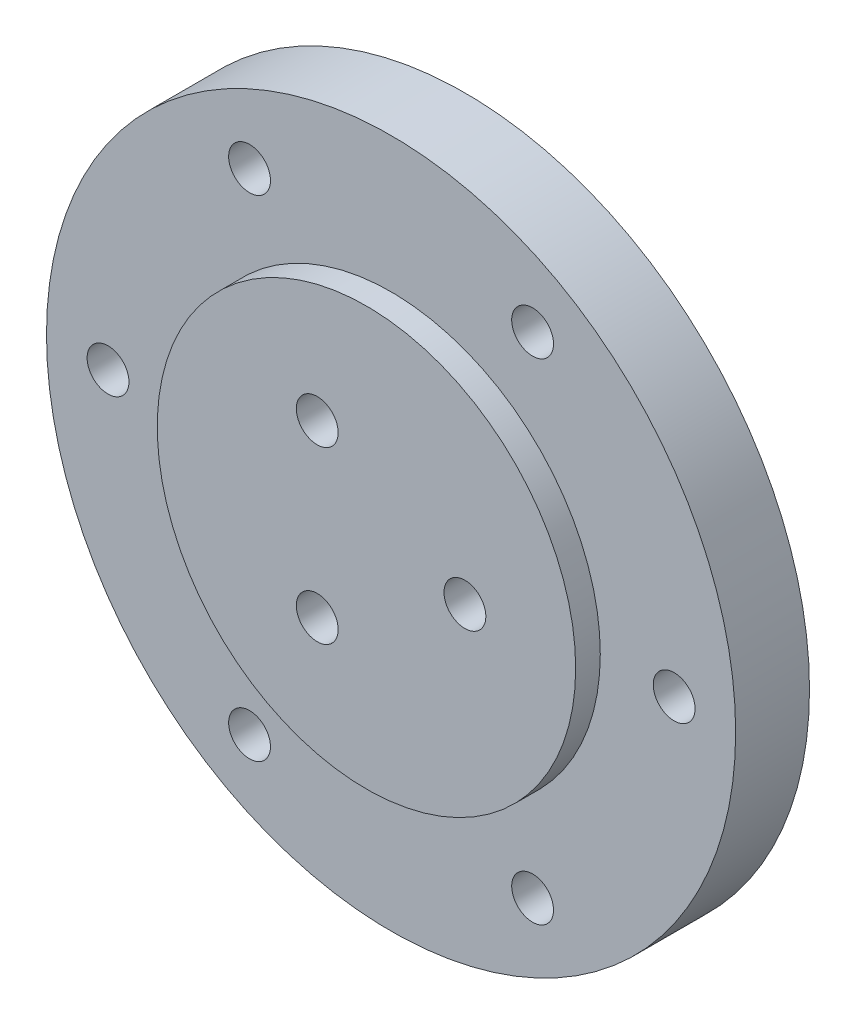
ISO-10303-21;
HEADER;
FILE_DESCRIPTION(('STEP AP214'),'2;1');
FILE_NAME('part.step','',(''),(''),'','','');
FILE_SCHEMA(('AUTOMOTIVE_DESIGN { 1 0 10303 214 1 1 1 1 }'));
ENDSEC;
DATA;
#1=APPLICATION_CONTEXT('core data for automotive mechanical design processes');
#2=APPLICATION_PROTOCOL_DEFINITION('international standard','automotive_design',2000,#1);
#3=PRODUCT_CONTEXT('',#1,'mechanical');
#4=PRODUCT('Part','Part','',(#3));
#5=PRODUCT_RELATED_PRODUCT_CATEGORY('part','',(#4));
#6=PRODUCT_DEFINITION_FORMATION('','',#4);
#7=PRODUCT_DEFINITION_CONTEXT('part definition',#1,'design');
#8=PRODUCT_DEFINITION('design','',#6,#7);
#9=PRODUCT_DEFINITION_SHAPE('','',#8);
#10=(LENGTH_UNIT() NAMED_UNIT(*) SI_UNIT(.MILLI.,.METRE.));
#11=(NAMED_UNIT(*) PLANE_ANGLE_UNIT() SI_UNIT($,.RADIAN.));
#12=(NAMED_UNIT(*) SI_UNIT($,.STERADIAN.) SOLID_ANGLE_UNIT());
#13=UNCERTAINTY_MEASURE_WITH_UNIT(LENGTH_MEASURE(1.E-05),#10,'distance_accuracy_value','');
#14=(GEOMETRIC_REPRESENTATION_CONTEXT(3) GLOBAL_UNCERTAINTY_ASSIGNED_CONTEXT((#13)) GLOBAL_UNIT_ASSIGNED_CONTEXT((#10,
#11,#12)) REPRESENTATION_CONTEXT('',''));
#15=CARTESIAN_POINT('',(0.,0.,0.));
#16=DIRECTION('',(0.,0.,1.));
#17=DIRECTION('',(1.,0.,0.));
#18=AXIS2_PLACEMENT_3D('',#15,#16,#17);
#19=CARTESIAN_POINT('',(0.,0.,8.));
#20=DIRECTION('',(0.,0.,1.));
#21=DIRECTION('',(1.,0.,0.));
#22=AXIS2_PLACEMENT_3D('',#19,#20,#21);
#23=PLANE('',#22);
#24=CARTESIAN_POINT('',(-4.,6.928203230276,8.));
#25=DIRECTION('',(0.,0.,1.));
#26=DIRECTION('',(1.,0.,0.));
#27=AXIS2_PLACEMENT_3D('',#24,#25,#26);
#28=CIRCLE('',#27,1.7);
#29=CARTESIAN_POINT('',(-2.3,6.928203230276,8.));
#30=VERTEX_POINT('',#29);
#31=EDGE_CURVE('E21',#30,#30,#28,.T.);
#32=ORIENTED_EDGE('',*,*,#31,.F.);
#33=EDGE_LOOP('',(#32));
#34=FACE_BOUND('',#33,.T.);
#35=CARTESIAN_POINT('',(8.,0.,8.));
#36=DIRECTION('',(0.,0.,1.));
#37=DIRECTION('',(1.,0.,0.));
#38=AXIS2_PLACEMENT_3D('',#35,#36,#37);
#39=CIRCLE('',#38,1.7);
#40=CARTESIAN_POINT('',(9.7,0.,8.));
#41=VERTEX_POINT('',#40);
#42=EDGE_CURVE('E26',#41,#41,#39,.T.);
#43=ORIENTED_EDGE('',*,*,#42,.F.);
#44=EDGE_LOOP('',(#43));
#45=FACE_BOUND('',#44,.T.);
#46=CARTESIAN_POINT('',(-4.,-6.928203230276,8.));
#47=DIRECTION('',(0.,0.,1.));
#48=DIRECTION('',(1.,0.,0.));
#49=AXIS2_PLACEMENT_3D('',#46,#47,#48);
#50=CIRCLE('',#49,1.7);
#51=CARTESIAN_POINT('',(-2.3,-6.928203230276,8.));
#52=VERTEX_POINT('',#51);
#53=EDGE_CURVE('E34',#52,#52,#50,.T.);
#54=ORIENTED_EDGE('',*,*,#53,.F.);
#55=EDGE_LOOP('',(#54));
#56=FACE_BOUND('',#55,.T.);
#57=CARTESIAN_POINT('',(0.,0.,8.));
#58=DIRECTION('',(0.,0.,1.));
#59=DIRECTION('',(1.,0.,0.));
#60=AXIS2_PLACEMENT_3D('',#57,#58,#59);
#61=CIRCLE('',#60,17.);
#62=CARTESIAN_POINT('',(17.,0.,8.));
#63=VERTEX_POINT('',#62);
#64=EDGE_CURVE('E9',#63,#63,#61,.T.);
#65=ORIENTED_EDGE('',*,*,#64,.T.);
#66=EDGE_LOOP('',(#65));
#67=FACE_BOUND('',#66,.T.);
#68=ADVANCED_FACE('F14',(#34,#45,#56,#67),#23,.T.);
#69=CARTESIAN_POINT('',(0.,0.,6.));
#70=DIRECTION('',(0.,0.,-1.));
#71=DIRECTION('',(1.,0.,0.));
#72=AXIS2_PLACEMENT_3D('',#69,#70,#71);
#73=CYLINDRICAL_SURFACE('',#72,17.);
#74=ORIENTED_EDGE('',*,*,#64,.F.);
#75=EDGE_LOOP('',(#74));
#76=FACE_BOUND('',#75,.T.);
#77=CARTESIAN_POINT('',(0.,0.,6.));
#78=DIRECTION('',(0.,0.,1.));
#79=DIRECTION('',(1.,0.,0.));
#80=AXIS2_PLACEMENT_3D('',#77,#78,#79);
#81=CIRCLE('',#80,17.);
#82=CARTESIAN_POINT('',(17.,0.,6.));
#83=VERTEX_POINT('',#82);
#84=EDGE_CURVE('E60',#83,#83,#81,.T.);
#85=ORIENTED_EDGE('',*,*,#84,.T.);
#86=EDGE_LOOP('',(#85));
#87=FACE_BOUND('',#86,.T.);
#88=ADVANCED_FACE('F113',(#76,#87),#73,.T.);
#89=CARTESIAN_POINT('',(11.5,19.918584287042,0.));
#90=DIRECTION('',(0.,0.,-1.));
#91=DIRECTION('',(1.,0.,0.));
#92=AXIS2_PLACEMENT_3D('',#89,#90,#91);
#93=CYLINDRICAL_SURFACE('',#92,1.7);
#94=CARTESIAN_POINT('',(11.5,19.918584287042,6.));
#95=DIRECTION('',(0.,0.,1.));
#96=DIRECTION('',(1.,0.,0.));
#97=AXIS2_PLACEMENT_3D('',#94,#95,#96);
#98=CIRCLE('',#97,1.7);
#99=CARTESIAN_POINT('',(13.2,19.918584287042,6.));
#100=VERTEX_POINT('',#99);
#101=EDGE_CURVE('E41',#100,#100,#98,.T.);
#102=ORIENTED_EDGE('',*,*,#101,.T.);
#103=EDGE_LOOP('',(#102));
#104=FACE_BOUND('',#103,.T.);
#105=CARTESIAN_POINT('',(11.5,19.918584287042,0.));
#106=DIRECTION('',(0.,0.,1.));
#107=DIRECTION('',(1.,0.,0.));
#108=AXIS2_PLACEMENT_3D('',#105,#106,#107);
#109=CIRCLE('',#108,1.7);
#110=CARTESIAN_POINT('',(13.2,19.918584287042,0.));
#111=VERTEX_POINT('',#110);
#112=EDGE_CURVE('E66',#111,#111,#109,.T.);
#113=ORIENTED_EDGE('',*,*,#112,.F.);
#114=EDGE_LOOP('',(#113));
#115=FACE_BOUND('',#114,.T.);
#116=ADVANCED_FACE('F149',(#104,#115),#93,.F.);
#117=CARTESIAN_POINT('',(-11.5,19.918584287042,0.));
#118=DIRECTION('',(0.,0.,-1.));
#119=DIRECTION('',(1.,0.,0.));
#120=AXIS2_PLACEMENT_3D('',#117,#118,#119);
#121=CYLINDRICAL_SURFACE('',#120,1.7);
#122=CARTESIAN_POINT('',(-11.5,19.918584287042,6.));
#123=DIRECTION('',(0.,0.,1.));
#124=DIRECTION('',(1.,0.,0.));
#125=AXIS2_PLACEMENT_3D('',#122,#123,#124);
#126=CIRCLE('',#125,1.7);
#127=CARTESIAN_POINT('',(-9.8,19.918584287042,6.));
#128=VERTEX_POINT('',#127);
#129=EDGE_CURVE('E44',#128,#128,#126,.T.);
#130=ORIENTED_EDGE('',*,*,#129,.T.);
#131=EDGE_LOOP('',(#130));
#132=FACE_BOUND('',#131,.T.);
#133=CARTESIAN_POINT('',(-11.5,19.918584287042,0.));
#134=DIRECTION('',(0.,0.,1.));
#135=DIRECTION('',(1.,0.,0.));
#136=AXIS2_PLACEMENT_3D('',#133,#134,#135);
#137=CIRCLE('',#136,1.7);
#138=CARTESIAN_POINT('',(-9.8,19.918584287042,0.));
#139=VERTEX_POINT('',#138);
#140=EDGE_CURVE('E70',#139,#139,#137,.T.);
#141=ORIENTED_EDGE('',*,*,#140,.F.);
#142=EDGE_LOOP('',(#141));
#143=FACE_BOUND('',#142,.T.);
#144=ADVANCED_FACE('F172',(#132,#143),#121,.F.);
#145=CARTESIAN_POINT('',(-4.,6.928203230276,0.));
#146=DIRECTION('',(0.,0.,-1.));
#147=DIRECTION('',(1.,0.,0.));
#148=AXIS2_PLACEMENT_3D('',#145,#146,#147);
#149=CYLINDRICAL_SURFACE('',#148,1.7);
#150=ORIENTED_EDGE('',*,*,#31,.T.);
#151=EDGE_LOOP('',(#150));
#152=FACE_BOUND('',#151,.T.);
#153=CARTESIAN_POINT('',(-4.,6.928203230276,0.));
#154=DIRECTION('',(0.,0.,1.));
#155=DIRECTION('',(1.,0.,0.));
#156=AXIS2_PLACEMENT_3D('',#153,#154,#155);
#157=CIRCLE('',#156,1.7);
#158=CARTESIAN_POINT('',(-2.3,6.928203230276,0.));
#159=VERTEX_POINT('',#158);
#160=EDGE_CURVE('E75',#159,#159,#157,.T.);
#161=ORIENTED_EDGE('',*,*,#160,.F.);
#162=EDGE_LOOP('',(#161));
#163=FACE_BOUND('',#162,.T.);
#164=ADVANCED_FACE('F189',(#152,#163),#149,.F.);
#165=CARTESIAN_POINT('',(-23.,0.,0.));
#166=DIRECTION('',(0.,0.,-1.));
#167=DIRECTION('',(1.,0.,0.));
#168=AXIS2_PLACEMENT_3D('',#165,#166,#167);
#169=CYLINDRICAL_SURFACE('',#168,1.7);
#170=CARTESIAN_POINT('',(-23.,0.,6.));
#171=DIRECTION('',(0.,0.,1.));
#172=DIRECTION('',(1.,0.,0.));
#173=AXIS2_PLACEMENT_3D('',#170,#171,#172);
#174=CIRCLE('',#173,1.7);
#175=CARTESIAN_POINT('',(-21.3,0.,6.));
#176=VERTEX_POINT('',#175);
#177=EDGE_CURVE('E47',#176,#176,#174,.T.);
#178=ORIENTED_EDGE('',*,*,#177,.T.);
#179=EDGE_LOOP('',(#178));
#180=FACE_BOUND('',#179,.T.);
#181=CARTESIAN_POINT('',(-23.,0.,0.));
#182=DIRECTION('',(0.,0.,1.));
#183=DIRECTION('',(1.,0.,0.));
#184=AXIS2_PLACEMENT_3D('',#181,#182,#183);
#185=CIRCLE('',#184,1.7);
#186=CARTESIAN_POINT('',(-21.3,0.,0.));
#187=VERTEX_POINT('',#186);
#188=EDGE_CURVE('E74',#187,#187,#185,.T.);
#189=ORIENTED_EDGE('',*,*,#188,.F.);
#190=EDGE_LOOP('',(#189));
#191=FACE_BOUND('',#190,.T.);
#192=ADVANCED_FACE('F190',(#180,#191),#169,.F.);
#193=CARTESIAN_POINT('',(23.,0.,0.));
#194=DIRECTION('',(0.,0.,-1.));
#195=DIRECTION('',(1.,0.,0.));
#196=AXIS2_PLACEMENT_3D('',#193,#194,#195);
#197=CYLINDRICAL_SURFACE('',#196,1.7);
#198=CARTESIAN_POINT('',(23.,0.,6.));
#199=DIRECTION('',(0.,0.,1.));
#200=DIRECTION('',(1.,0.,0.));
#201=AXIS2_PLACEMENT_3D('',#198,#199,#200);
#202=CIRCLE('',#201,1.7);
#203=CARTESIAN_POINT('',(24.7,0.,6.));
#204=VERTEX_POINT('',#203);
#205=EDGE_CURVE('E52',#204,#204,#202,.T.);
#206=ORIENTED_EDGE('',*,*,#205,.T.);
#207=EDGE_LOOP('',(#206));
#208=FACE_BOUND('',#207,.T.);
#209=CARTESIAN_POINT('',(23.,0.,0.));
#210=DIRECTION('',(0.,0.,1.));
#211=DIRECTION('',(1.,0.,0.));
#212=AXIS2_PLACEMENT_3D('',#209,#210,#211);
#213=CIRCLE('',#212,1.7);
#214=CARTESIAN_POINT('',(24.7,0.,0.));
#215=VERTEX_POINT('',#214);
#216=EDGE_CURVE('E78',#215,#215,#213,.T.);
#217=ORIENTED_EDGE('',*,*,#216,.F.);
#218=EDGE_LOOP('',(#217));
#219=FACE_BOUND('',#218,.T.);
#220=ADVANCED_FACE('F183',(#208,#219),#197,.F.);
#221=CARTESIAN_POINT('',(8.,0.,0.));
#222=DIRECTION('',(0.,0.,-1.));
#223=DIRECTION('',(1.,0.,0.));
#224=AXIS2_PLACEMENT_3D('',#221,#222,#223);
#225=CYLINDRICAL_SURFACE('',#224,1.7);
#226=ORIENTED_EDGE('',*,*,#42,.T.);
#227=EDGE_LOOP('',(#226));
#228=FACE_BOUND('',#227,.T.);
#229=CARTESIAN_POINT('',(8.,0.,0.));
#230=DIRECTION('',(0.,0.,1.));
#231=DIRECTION('',(1.,0.,0.));
#232=AXIS2_PLACEMENT_3D('',#229,#230,#231);
#233=CIRCLE('',#232,1.7);
#234=CARTESIAN_POINT('',(9.7,0.,0.));
#235=VERTEX_POINT('',#234);
#236=EDGE_CURVE('E84',#235,#235,#233,.T.);
#237=ORIENTED_EDGE('',*,*,#236,.F.);
#238=EDGE_LOOP('',(#237));
#239=FACE_BOUND('',#238,.T.);
#240=ADVANCED_FACE('F176',(#228,#239),#225,.F.);
#241=CARTESIAN_POINT('',(11.5,-19.91858428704,0.));
#242=DIRECTION('',(0.,0.,-1.));
#243=DIRECTION('',(1.,0.,0.));
#244=AXIS2_PLACEMENT_3D('',#241,#242,#243);
#245=CYLINDRICAL_SURFACE('',#244,1.7);
#246=CARTESIAN_POINT('',(11.5,-19.91858428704,6.));
#247=DIRECTION('',(0.,0.,1.));
#248=DIRECTION('',(1.,0.,0.));
#249=AXIS2_PLACEMENT_3D('',#246,#247,#248);
#250=CIRCLE('',#249,1.7);
#251=CARTESIAN_POINT('',(13.2,-19.91858428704,6.));
#252=VERTEX_POINT('',#251);
#253=EDGE_CURVE('E59',#252,#252,#250,.T.);
#254=ORIENTED_EDGE('',*,*,#253,.T.);
#255=EDGE_LOOP('',(#254));
#256=FACE_BOUND('',#255,.T.);
#257=CARTESIAN_POINT('',(11.5,-19.91858428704,0.));
#258=DIRECTION('',(0.,0.,1.));
#259=DIRECTION('',(1.,0.,0.));
#260=AXIS2_PLACEMENT_3D('',#257,#258,#259);
#261=CIRCLE('',#260,1.7);
#262=CARTESIAN_POINT('',(13.2,-19.91858428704,0.));
#263=VERTEX_POINT('',#262);
#264=EDGE_CURVE('E87',#263,#263,#261,.T.);
#265=ORIENTED_EDGE('',*,*,#264,.F.);
#266=EDGE_LOOP('',(#265));
#267=FACE_BOUND('',#266,.T.);
#268=ADVANCED_FACE('F159',(#256,#267),#245,.F.);
#269=CARTESIAN_POINT('',(-4.,-6.928203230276,0.));
#270=DIRECTION('',(0.,0.,-1.));
#271=DIRECTION('',(1.,0.,0.));
#272=AXIS2_PLACEMENT_3D('',#269,#270,#271);
#273=CYLINDRICAL_SURFACE('',#272,1.7);
#274=ORIENTED_EDGE('',*,*,#53,.T.);
#275=EDGE_LOOP('',(#274));
#276=FACE_BOUND('',#275,.T.);
#277=CARTESIAN_POINT('',(-4.,-6.928203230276,0.));
#278=DIRECTION('',(0.,0.,1.));
#279=DIRECTION('',(1.,0.,0.));
#280=AXIS2_PLACEMENT_3D('',#277,#278,#279);
#281=CIRCLE('',#280,1.7);
#282=CARTESIAN_POINT('',(-2.3,-6.928203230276,0.));
#283=VERTEX_POINT('',#282);
#284=EDGE_CURVE('E93',#283,#283,#281,.T.);
#285=ORIENTED_EDGE('',*,*,#284,.F.);
#286=EDGE_LOOP('',(#285));
#287=FACE_BOUND('',#286,.T.);
#288=ADVANCED_FACE('F160',(#276,#287),#273,.F.);
#289=CARTESIAN_POINT('',(-11.5,-19.91858428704,0.));
#290=DIRECTION('',(0.,0.,-1.));
#291=DIRECTION('',(1.,0.,0.));
#292=AXIS2_PLACEMENT_3D('',#289,#290,#291);
#293=CYLINDRICAL_SURFACE('',#292,1.7);
#294=CARTESIAN_POINT('',(-11.5,-19.91858428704,6.));
#295=DIRECTION('',(0.,0.,1.));
#296=DIRECTION('',(1.,0.,0.));
#297=AXIS2_PLACEMENT_3D('',#294,#295,#296);
#298=CIRCLE('',#297,1.7);
#299=CARTESIAN_POINT('',(-9.8,-19.91858428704,6.));
#300=VERTEX_POINT('',#299);
#301=EDGE_CURVE('E62',#300,#300,#298,.T.);
#302=ORIENTED_EDGE('',*,*,#301,.T.);
#303=EDGE_LOOP('',(#302));
#304=FACE_BOUND('',#303,.T.);
#305=CARTESIAN_POINT('',(-11.5,-19.91858428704,0.));
#306=DIRECTION('',(0.,0.,1.));
#307=DIRECTION('',(1.,0.,0.));
#308=AXIS2_PLACEMENT_3D('',#305,#306,#307);
#309=CIRCLE('',#308,1.7);
#310=CARTESIAN_POINT('',(-9.8,-19.91858428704,0.));
#311=VERTEX_POINT('',#310);
#312=EDGE_CURVE('E92',#311,#311,#309,.T.);
#313=ORIENTED_EDGE('',*,*,#312,.F.);
#314=EDGE_LOOP('',(#313));
#315=FACE_BOUND('',#314,.T.);
#316=ADVANCED_FACE('F121',(#304,#315),#293,.F.);
#317=CARTESIAN_POINT('',(0.,0.,6.));
#318=DIRECTION('',(0.,0.,1.));
#319=DIRECTION('',(1.,0.,0.));
#320=AXIS2_PLACEMENT_3D('',#317,#318,#319);
#321=PLANE('',#320);
#322=ORIENTED_EDGE('',*,*,#101,.F.);
#323=EDGE_LOOP('',(#322));
#324=FACE_BOUND('',#323,.T.);
#325=ORIENTED_EDGE('',*,*,#129,.F.);
#326=EDGE_LOOP('',(#325));
#327=FACE_BOUND('',#326,.T.);
#328=ORIENTED_EDGE('',*,*,#177,.F.);
#329=EDGE_LOOP('',(#328));
#330=FACE_BOUND('',#329,.T.);
#331=ORIENTED_EDGE('',*,*,#205,.F.);
#332=EDGE_LOOP('',(#331));
#333=FACE_BOUND('',#332,.T.);
#334=ORIENTED_EDGE('',*,*,#84,.F.);
#335=EDGE_LOOP('',(#334));
#336=FACE_BOUND('',#335,.T.);
#337=ORIENTED_EDGE('',*,*,#253,.F.);
#338=EDGE_LOOP('',(#337));
#339=FACE_BOUND('',#338,.T.);
#340=ORIENTED_EDGE('',*,*,#301,.F.);
#341=EDGE_LOOP('',(#340));
#342=FACE_BOUND('',#341,.T.);
#343=CARTESIAN_POINT('',(0.,0.,6.));
#344=DIRECTION('',(0.,0.,1.));
#345=DIRECTION('',(1.,0.,0.));
#346=AXIS2_PLACEMENT_3D('',#343,#344,#345);
#347=CIRCLE('',#346,28.);
#348=CARTESIAN_POINT('',(28.,0.,6.));
#349=VERTEX_POINT('',#348);
#350=EDGE_CURVE('E97',#349,#349,#347,.T.);
#351=ORIENTED_EDGE('',*,*,#350,.T.);
#352=EDGE_LOOP('',(#351));
#353=FACE_BOUND('',#352,.T.);
#354=ADVANCED_FACE('F117',(#324,#327,#330,#333,#336,#339,#342,#353),#321,.T.);
#355=CARTESIAN_POINT('',(0.,0.,0.));
#356=DIRECTION('',(0.,0.,1.));
#357=DIRECTION('',(1.,0.,0.));
#358=AXIS2_PLACEMENT_3D('',#355,#356,#357);
#359=PLANE('',#358);
#360=ORIENTED_EDGE('',*,*,#112,.T.);
#361=EDGE_LOOP('',(#360));
#362=FACE_BOUND('',#361,.T.);
#363=ORIENTED_EDGE('',*,*,#140,.T.);
#364=EDGE_LOOP('',(#363));
#365=FACE_BOUND('',#364,.T.);
#366=ORIENTED_EDGE('',*,*,#160,.T.);
#367=EDGE_LOOP('',(#366));
#368=FACE_BOUND('',#367,.T.);
#369=ORIENTED_EDGE('',*,*,#188,.T.);
#370=EDGE_LOOP('',(#369));
#371=FACE_BOUND('',#370,.T.);
#372=ORIENTED_EDGE('',*,*,#216,.T.);
#373=EDGE_LOOP('',(#372));
#374=FACE_BOUND('',#373,.T.);
#375=ORIENTED_EDGE('',*,*,#236,.T.);
#376=EDGE_LOOP('',(#375));
#377=FACE_BOUND('',#376,.T.);
#378=ORIENTED_EDGE('',*,*,#264,.T.);
#379=EDGE_LOOP('',(#378));
#380=FACE_BOUND('',#379,.T.);
#381=ORIENTED_EDGE('',*,*,#284,.T.);
#382=EDGE_LOOP('',(#381));
#383=FACE_BOUND('',#382,.T.);
#384=ORIENTED_EDGE('',*,*,#312,.T.);
#385=EDGE_LOOP('',(#384));
#386=FACE_BOUND('',#385,.T.);
#387=CARTESIAN_POINT('',(0.,0.,0.));
#388=DIRECTION('',(0.,0.,1.));
#389=DIRECTION('',(1.,0.,0.));
#390=AXIS2_PLACEMENT_3D('',#387,#388,#389);
#391=CIRCLE('',#390,28.);
#392=CARTESIAN_POINT('',(28.,0.,0.));
#393=VERTEX_POINT('',#392);
#394=EDGE_CURVE('E103',#393,#393,#391,.T.);
#395=ORIENTED_EDGE('',*,*,#394,.F.);
#396=EDGE_LOOP('',(#395));
#397=FACE_BOUND('',#396,.T.);
#398=ADVANCED_FACE('F120',(#362,#365,#368,#371,#374,#377,#380,#383,#386,#397),#359,.F.);
#399=CARTESIAN_POINT('',(0.,0.,0.));
#400=DIRECTION('',(0.,0.,-1.));
#401=DIRECTION('',(1.,0.,0.));
#402=AXIS2_PLACEMENT_3D('',#399,#400,#401);
#403=CYLINDRICAL_SURFACE('',#402,28.);
#404=ORIENTED_EDGE('',*,*,#350,.F.);
#405=EDGE_LOOP('',(#404));
#406=FACE_BOUND('',#405,.T.);
#407=ORIENTED_EDGE('',*,*,#394,.T.);
#408=EDGE_LOOP('',(#407));
#409=FACE_BOUND('',#408,.T.);
#410=ADVANCED_FACE('F129',(#406,#409),#403,.T.);
#411=CLOSED_SHELL('',(#68,#88,#116,#144,#164,#192,#220,#240,#268,#288,#316,#354,#398,#410));
#412=MANIFOLD_SOLID_BREP('B1',#411);
#413=ADVANCED_BREP_SHAPE_REPRESENTATION('',(#18,#412),#14);
#414=SHAPE_DEFINITION_REPRESENTATION(#9,#413);
ENDSEC;
END-ISO-10303-21;
